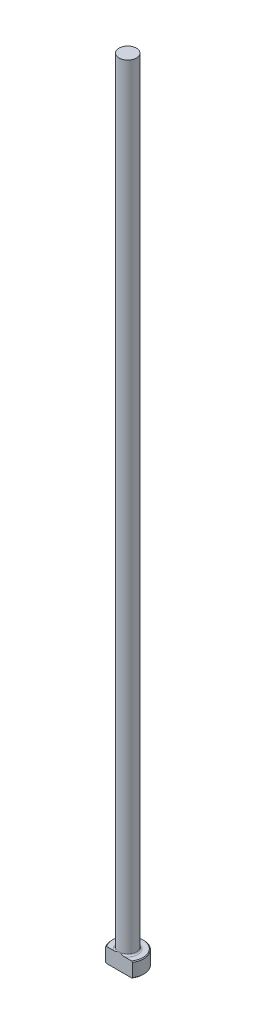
from build123d import *

# Parameters (mm, degrees)
CHAMFER1_SIZE = 0.254
FILLET1_R     = 0.508
KEY_DEPTH     = 255.104649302


with BuildPart() as part:
    # Sketch1 → Revolve1 (revolve)
    with BuildSketch(Plane.XY, mode=Mode.PRIVATE) as revolve1_sk:
        Polygon((0, 0), (-5.1562, 0), (-5.1562, 4.7498), (-2.77749, 4.7498), (-2.77749, 254), (0, 254), align=None)
    revolve(revolve1_sk.sketch.rotate(Axis((0, 259.958771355, 0), (0, -1, 0)), 270), axis=Axis((0, 259.958771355, 0), (0, -1, 0)))

    # Chamfer1
    chamfer1_edges = [part.edges().sort_by_distance(p)[0] for p in [
        (0, 4.7498, -5.1562),
        (0, 0, -5.1562),
    ]]
    chamfer(chamfer1_edges, length=CHAMFER1_SIZE)

    # Fillet1
    fillet1_edges = [part.edges().sort_by_distance(p)[0] for p in [
        (0, 4.7498, -2.77749),
    ]]
    fillet(fillet1_edges, radius=FILLET1_R)

    # Sketch2 → KEY (cut, through all)
    with BuildSketch(Plane.XZ):
        with BuildLine():
            Line((-4.344185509, 2.77749), (4.344185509, 2.77749))
            ThreePointArc((4.344185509, 2.77749), (0, 5.1562), (-4.344185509, 2.77749))
        make_face()
    extrude(amount=-KEY_DEPTH, mode=Mode.SUBTRACT)


solid = part.part
